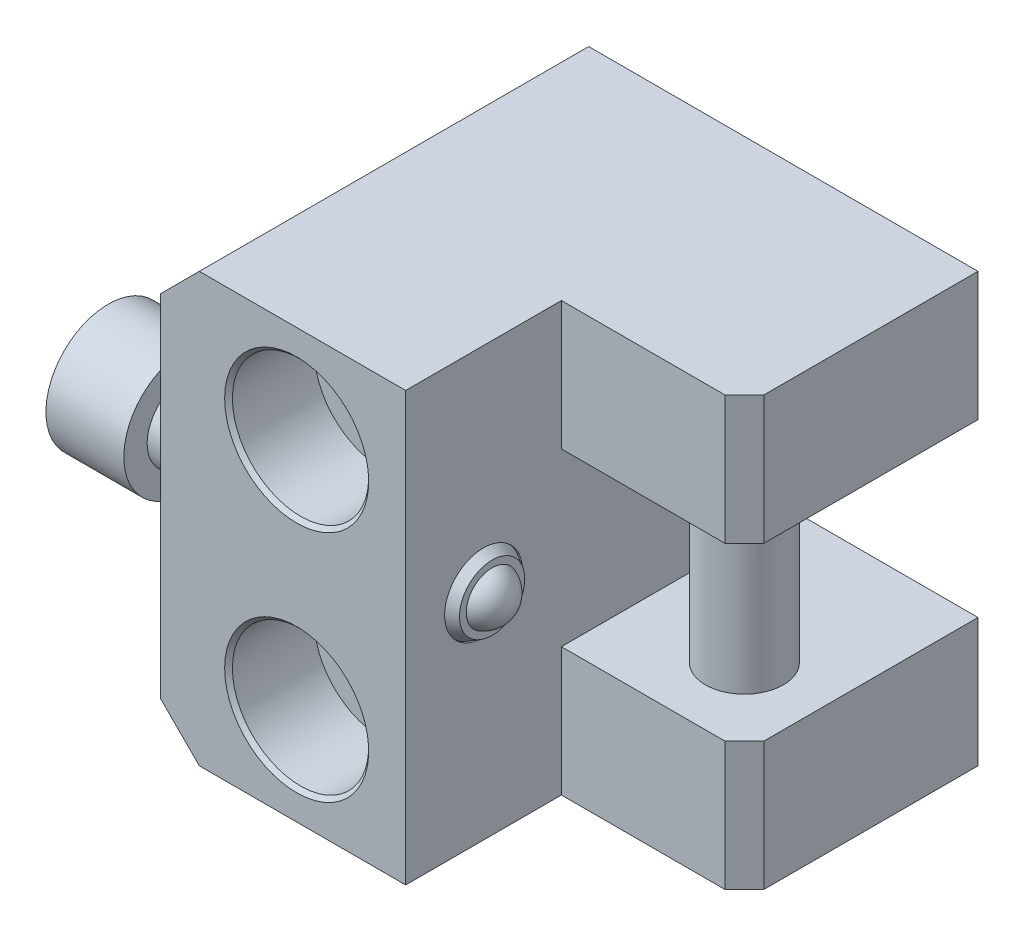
ISO-10303-21;
HEADER;
FILE_DESCRIPTION(('STEP AP214'),'2;1');
FILE_NAME('part.step','',(''),(''),'','','');
FILE_SCHEMA(('AUTOMOTIVE_DESIGN { 1 0 10303 214 1 1 1 1 }'));
ENDSEC;
DATA;
#1=APPLICATION_CONTEXT('core data for automotive mechanical design processes');
#2=APPLICATION_PROTOCOL_DEFINITION('international standard','automotive_design',2000,#1);
#3=PRODUCT_CONTEXT('',#1,'mechanical');
#4=PRODUCT('Part','Part','',(#3));
#5=PRODUCT_RELATED_PRODUCT_CATEGORY('part','',(#4));
#6=PRODUCT_DEFINITION_FORMATION('','',#4);
#7=PRODUCT_DEFINITION_CONTEXT('part definition',#1,'design');
#8=PRODUCT_DEFINITION('design','',#6,#7);
#9=PRODUCT_DEFINITION_SHAPE('','',#8);
#10=(LENGTH_UNIT() NAMED_UNIT(*) SI_UNIT(.MILLI.,.METRE.));
#11=(NAMED_UNIT(*) PLANE_ANGLE_UNIT() SI_UNIT($,.RADIAN.));
#12=(NAMED_UNIT(*) SI_UNIT($,.STERADIAN.) SOLID_ANGLE_UNIT());
#13=UNCERTAINTY_MEASURE_WITH_UNIT(LENGTH_MEASURE(1.E-05),#10,'distance_accuracy_value','');
#14=(GEOMETRIC_REPRESENTATION_CONTEXT(3) GLOBAL_UNCERTAINTY_ASSIGNED_CONTEXT((#13)) GLOBAL_UNIT_ASSIGNED_CONTEXT((#10,
#11,#12)) REPRESENTATION_CONTEXT('',''));
#15=CARTESIAN_POINT('',(0.,0.,0.));
#16=DIRECTION('',(0.,0.,1.));
#17=DIRECTION('',(1.,0.,0.));
#18=AXIS2_PLACEMENT_3D('',#15,#16,#17);
#19=CARTESIAN_POINT('',(-29.2000000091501,22.306119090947,43.25892983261));
#20=DIRECTION('',(-1.,-4.10206894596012E-10,0.));
#21=DIRECTION('',(3.74627505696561E-10,-0.913264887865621,-0.407366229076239));
#22=AXIS2_PLACEMENT_3D('',#19,#20,#21);
#23=PLANE('',#22);
#24=DIRECTION('',(2.40884665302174E-10,-0.587227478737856,-0.809421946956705));
#25=VECTOR('',#24,1.);
#26=CARTESIAN_POINT('',(-29.2000000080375,19.5938315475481,39.5203700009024));
#27=LINE('',#26,#25);
#28=CARTESIAN_POINT('',(-29.2000000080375,19.5938315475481,39.5203700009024));
#29=VERTEX_POINT('',#28);
#30=CARTESIAN_POINT('',(-29.2000000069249,16.8815440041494,35.7818101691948));
#31=VERTEX_POINT('',#30);
#32=EDGE_CURVE('E372',#29,#31,#27,.T.);
#33=ORIENTED_EDGE('',*,*,#32,.T.);
#34=DIRECTION('',(-4.0798920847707E-10,0.994593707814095,-0.103842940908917));
#35=VECTOR('',#34,1.);
#36=CARTESIAN_POINT('',(-29.2000000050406,12.2877124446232,36.2614401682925));
#37=LINE('',#36,#35);
#38=CARTESIAN_POINT('',(-29.2000000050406,12.2877124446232,36.2614401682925));
#39=VERTEX_POINT('',#38);
#40=EDGE_CURVE('E374',#39,#31,#37,.T.);
#41=ORIENTED_EDGE('',*,*,#40,.F.);
#42=DIRECTION('',(-1.67104543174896E-10,0.407366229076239,-0.913264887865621));
#43=VECTOR('',#42,1.);
#44=CARTESIAN_POINT('',(-29.2000000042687,10.4061684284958,40.4796299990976));
#45=LINE('',#44,#43);
#46=CARTESIAN_POINT('',(-29.2000000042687,10.4061684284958,40.4796299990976));
#47=VERTEX_POINT('',#46);
#48=EDGE_CURVE('E377',#47,#39,#45,.T.);
#49=ORIENTED_EDGE('',*,*,#48,.F.);
#50=DIRECTION('',(-2.40884665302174E-10,0.587227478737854,0.809421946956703));
#51=VECTOR('',#50,1.);
#52=CARTESIAN_POINT('',(-29.2000000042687,10.4061684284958,40.4796299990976));
#53=LINE('',#52,#51);
#54=CARTESIAN_POINT('',(-29.2000000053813,13.1184559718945,44.2181898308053));
#55=VERTEX_POINT('',#54);
#56=EDGE_CURVE('E182',#47,#55,#53,.T.);
#57=ORIENTED_EDGE('',*,*,#56,.T.);
#58=DIRECTION('',(4.0798920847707E-10,-0.994593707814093,0.103842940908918));
#59=VECTOR('',#58,1.);
#60=CARTESIAN_POINT('',(-29.2000000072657,17.7122875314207,43.7385598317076));
#61=LINE('',#60,#59);
#62=CARTESIAN_POINT('',(-29.2000000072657,17.7122875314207,43.7385598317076));
#63=VERTEX_POINT('',#62);
#64=EDGE_CURVE('E165',#63,#55,#61,.T.);
#65=ORIENTED_EDGE('',*,*,#64,.F.);
#66=DIRECTION('',(-1.67104543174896E-10,0.407366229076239,-0.913264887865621));
#67=VECTOR('',#66,1.);
#68=CARTESIAN_POINT('',(-29.2000000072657,17.7122875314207,43.7385598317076));
#69=LINE('',#68,#67);
#70=EDGE_CURVE('E179',#63,#29,#69,.T.);
#71=ORIENTED_EDGE('',*,*,#70,.T.);
#72=EDGE_LOOP('',(#33,#41,#49,#57,#65,#71));
#73=FACE_BOUND('',#72,.T.);
#74=ADVANCED_FACE('F14',(#73),#23,.T.);
#75=CARTESIAN_POINT('',(-29.2000000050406,12.2877124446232,36.2614401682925));
#76=DIRECTION('',(-4.25969733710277E-11,0.103842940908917,0.994593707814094));
#77=DIRECTION('',(4.0798920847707E-10,-0.994593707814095,0.103842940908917));
#78=AXIS2_PLACEMENT_3D('',#75,#76,#77);
#79=PLANE('',#78);
#80=ORIENTED_EDGE('',*,*,#40,.T.);
#81=DIRECTION('',(-1.,-4.10206894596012E-10,0.));
#82=VECTOR('',#81,1.);
#83=CARTESIAN_POINT('',(-29.2000000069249,16.8815440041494,35.7818101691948));
#84=LINE('',#83,#82);
#85=CARTESIAN_POINT('',(-34.2000000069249,16.8815440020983,35.7818101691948));
#86=VERTEX_POINT('',#85);
#87=EDGE_CURVE('E186',#31,#86,#84,.T.);
#88=ORIENTED_EDGE('',*,*,#87,.T.);
#89=DIRECTION('',(-4.0798920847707E-10,0.994593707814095,-0.103842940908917));
#90=VECTOR('',#89,1.);
#91=CARTESIAN_POINT('',(-34.2000000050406,12.2877124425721,36.2614401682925));
#92=LINE('',#91,#90);
#93=CARTESIAN_POINT('',(-34.2000000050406,12.2877124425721,36.2614401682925));
#94=VERTEX_POINT('',#93);
#95=EDGE_CURVE('E358',#94,#86,#92,.T.);
#96=ORIENTED_EDGE('',*,*,#95,.F.);
#97=DIRECTION('',(-1.,-4.10206894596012E-10,0.));
#98=VECTOR('',#97,1.);
#99=CARTESIAN_POINT('',(-29.2000000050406,12.2877124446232,36.2614401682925));
#100=LINE('',#99,#98);
#101=EDGE_CURVE('E136',#39,#94,#100,.T.);
#102=ORIENTED_EDGE('',*,*,#101,.F.);
#103=EDGE_LOOP('',(#80,#88,#96,#102));
#104=FACE_BOUND('',#103,.T.);
#105=ADVANCED_FACE('F387',(#104),#79,.T.);
#106=CARTESIAN_POINT('',(-29.2000000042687,10.4061684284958,40.4796299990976));
#107=DIRECTION('',(-3.74627505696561E-10,0.913264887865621,0.407366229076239));
#108=DIRECTION('',(-1.,-4.10206894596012E-10,0.));
#109=AXIS2_PLACEMENT_3D('',#106,#107,#108);
#110=PLANE('',#109);
#111=ORIENTED_EDGE('',*,*,#101,.T.);
#112=DIRECTION('',(-1.67104543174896E-10,0.407366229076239,-0.913264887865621));
#113=VECTOR('',#112,1.);
#114=CARTESIAN_POINT('',(-34.2000000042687,10.4061684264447,40.4796299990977));
#115=LINE('',#114,#113);
#116=CARTESIAN_POINT('',(-34.2000000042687,10.4061684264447,40.4796299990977));
#117=VERTEX_POINT('',#116);
#118=EDGE_CURVE('E361',#117,#94,#115,.T.);
#119=ORIENTED_EDGE('',*,*,#118,.F.);
#120=DIRECTION('',(-1.,-4.10206894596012E-10,0.));
#121=VECTOR('',#120,1.);
#122=CARTESIAN_POINT('',(-29.2000000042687,10.4061684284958,40.4796299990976));
#123=LINE('',#122,#121);
#124=EDGE_CURVE('E192',#47,#117,#123,.T.);
#125=ORIENTED_EDGE('',*,*,#124,.F.);
#126=ORIENTED_EDGE('',*,*,#48,.T.);
#127=EDGE_LOOP('',(#111,#119,#125,#126));
#128=FACE_BOUND('',#127,.T.);
#129=ADVANCED_FACE('F378',(#128),#110,.T.);
#130=CARTESIAN_POINT('',(-29.2000000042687,10.4061684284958,40.4796299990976));
#131=DIRECTION('',(3.32030532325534E-10,-0.809421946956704,0.587227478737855));
#132=DIRECTION('',(2.40884665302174E-10,-0.587227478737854,-0.809421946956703));
#133=AXIS2_PLACEMENT_3D('',#130,#131,#132);
#134=PLANE('',#133);
#135=ORIENTED_EDGE('',*,*,#124,.T.);
#136=DIRECTION('',(-2.40884665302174E-10,0.587227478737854,0.809421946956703));
#137=VECTOR('',#136,1.);
#138=CARTESIAN_POINT('',(-34.2000000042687,10.4061684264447,40.4796299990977));
#139=LINE('',#138,#137);
#140=CARTESIAN_POINT('',(-34.2000000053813,13.1184559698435,44.2181898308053));
#141=VERTEX_POINT('',#140);
#142=EDGE_CURVE('E366',#117,#141,#139,.T.);
#143=ORIENTED_EDGE('',*,*,#142,.T.);
#144=DIRECTION('',(-1.,-4.10206894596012E-10,0.));
#145=VECTOR('',#144,1.);
#146=CARTESIAN_POINT('',(-29.2000000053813,13.1184559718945,44.2181898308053));
#147=LINE('',#146,#145);
#148=EDGE_CURVE('E173',#55,#141,#147,.T.);
#149=ORIENTED_EDGE('',*,*,#148,.F.);
#150=ORIENTED_EDGE('',*,*,#56,.F.);
#151=EDGE_LOOP('',(#135,#143,#149,#150));
#152=FACE_BOUND('',#151,.T.);
#153=ADVANCED_FACE('F381',(#152),#134,.F.);
#154=CARTESIAN_POINT('',(-29.2000000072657,17.7122875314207,43.7385598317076));
#155=DIRECTION('',(4.2596973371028E-11,-0.103842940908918,-0.994593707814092));
#156=DIRECTION('',(-4.0798920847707E-10,0.994593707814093,-0.103842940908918));
#157=AXIS2_PLACEMENT_3D('',#154,#155,#156);
#158=PLANE('',#157);
#159=ORIENTED_EDGE('',*,*,#148,.T.);
#160=DIRECTION('',(4.0798920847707E-10,-0.994593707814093,0.103842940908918));
#161=VECTOR('',#160,1.);
#162=CARTESIAN_POINT('',(-34.2000000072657,17.7122875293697,43.7385598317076));
#163=LINE('',#162,#161);
#164=CARTESIAN_POINT('',(-34.2000000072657,17.7122875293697,43.7385598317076));
#165=VERTEX_POINT('',#164);
#166=EDGE_CURVE('E167',#165,#141,#163,.T.);
#167=ORIENTED_EDGE('',*,*,#166,.F.);
#168=DIRECTION('',(-1.,-4.10206894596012E-10,0.));
#169=VECTOR('',#168,1.);
#170=CARTESIAN_POINT('',(-29.2000000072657,17.7122875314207,43.7385598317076));
#171=LINE('',#170,#169);
#172=EDGE_CURVE('E162',#63,#165,#171,.T.);
#173=ORIENTED_EDGE('',*,*,#172,.F.);
#174=ORIENTED_EDGE('',*,*,#64,.T.);
#175=EDGE_LOOP('',(#159,#167,#173,#174));
#176=FACE_BOUND('',#175,.T.);
#177=ADVANCED_FACE('F164',(#176),#158,.T.);
#178=CARTESIAN_POINT('',(-29.2000000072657,17.7122875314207,43.7385598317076));
#179=DIRECTION('',(-3.74627505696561E-10,0.913264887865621,0.407366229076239));
#180=DIRECTION('',(-1.,-4.10206894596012E-10,0.));
#181=AXIS2_PLACEMENT_3D('',#178,#179,#180);
#182=PLANE('',#181);
#183=ORIENTED_EDGE('',*,*,#172,.T.);
#184=DIRECTION('',(-1.67104543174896E-10,0.407366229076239,-0.913264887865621));
#185=VECTOR('',#184,1.);
#186=CARTESIAN_POINT('',(-34.2000000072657,17.7122875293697,43.7385598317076));
#187=LINE('',#186,#185);
#188=CARTESIAN_POINT('',(-34.2000000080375,19.5938315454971,39.5203700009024));
#189=VERTEX_POINT('',#188);
#190=EDGE_CURVE('E370',#165,#189,#187,.T.);
#191=ORIENTED_EDGE('',*,*,#190,.T.);
#192=DIRECTION('',(-1.,-4.10206894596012E-10,0.));
#193=VECTOR('',#192,1.);
#194=CARTESIAN_POINT('',(-29.2000000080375,19.5938315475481,39.5203700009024));
#195=LINE('',#194,#193);
#196=EDGE_CURVE('E172',#29,#189,#195,.T.);
#197=ORIENTED_EDGE('',*,*,#196,.F.);
#198=ORIENTED_EDGE('',*,*,#70,.F.);
#199=EDGE_LOOP('',(#183,#191,#197,#198));
#200=FACE_BOUND('',#199,.T.);
#201=ADVANCED_FACE('F184',(#200),#182,.F.);
#202=CARTESIAN_POINT('',(-29.2000000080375,19.5938315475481,39.5203700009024));
#203=DIRECTION('',(-3.32030532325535E-10,0.809421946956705,-0.587227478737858));
#204=DIRECTION('',(-2.40884665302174E-10,0.587227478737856,0.809421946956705));
#205=AXIS2_PLACEMENT_3D('',#202,#203,#204);
#206=PLANE('',#205);
#207=ORIENTED_EDGE('',*,*,#196,.T.);
#208=DIRECTION('',(2.40884665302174E-10,-0.587227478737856,-0.809421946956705));
#209=VECTOR('',#208,1.);
#210=CARTESIAN_POINT('',(-34.2000000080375,19.5938315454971,39.5203700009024));
#211=LINE('',#210,#209);
#212=EDGE_CURVE('E33',#189,#86,#211,.T.);
#213=ORIENTED_EDGE('',*,*,#212,.T.);
#214=ORIENTED_EDGE('',*,*,#87,.F.);
#215=ORIENTED_EDGE('',*,*,#32,.F.);
#216=EDGE_LOOP('',(#207,#213,#214,#215));
#217=FACE_BOUND('',#216,.T.);
#218=ADVANCED_FACE('F388',(#217),#206,.F.);
#219=CARTESIAN_POINT('',(-34.2000000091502,22.3061190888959,43.25892983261));
#220=DIRECTION('',(-1.,-4.10206894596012E-10,0.));
#221=DIRECTION('',(3.74627505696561E-10,-0.913264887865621,-0.407366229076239));
#222=AXIS2_PLACEMENT_3D('',#219,#220,#221);
#223=PLANE('',#222);
#224=ORIENTED_EDGE('',*,*,#212,.F.);
#225=ORIENTED_EDGE('',*,*,#190,.F.);
#226=ORIENTED_EDGE('',*,*,#166,.T.);
#227=ORIENTED_EDGE('',*,*,#142,.F.);
#228=ORIENTED_EDGE('',*,*,#118,.T.);
#229=ORIENTED_EDGE('',*,*,#95,.T.);
#230=EDGE_LOOP('',(#224,#225,#226,#227,#228,#229));
#231=FACE_BOUND('',#230,.T.);
#232=CARTESIAN_POINT('',(-34.2000000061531,14.9999999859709,40.));
#233=DIRECTION('',(1.,4.10206894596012E-10,0.));
#234=DIRECTION('',(-3.74627505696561E-10,0.913264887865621,0.407366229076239));
#235=AXIS2_PLACEMENT_3D('',#232,#233,#234);
#236=CIRCLE('',#235,8.);
#237=CARTESIAN_POINT('',(-34.2000000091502,22.3061190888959,43.2589298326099));
#238=VERTEX_POINT('',#237);
#239=EDGE_CURVE('E196',#238,#238,#236,.T.);
#240=ORIENTED_EDGE('',*,*,#239,.F.);
#241=EDGE_LOOP('',(#240));
#242=FACE_BOUND('',#241,.T.);
#243=ADVANCED_FACE('F384',(#231,#242),#223,.T.);
#244=CARTESIAN_POINT('',(25.7999999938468,15.0000000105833,40.));
#245=DIRECTION('',(1.,4.10206894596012E-10,0.));
#246=DIRECTION('',(-3.74627505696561E-10,0.913264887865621,0.407366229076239));
#247=AXIS2_PLACEMENT_3D('',#244,#245,#246);
#248=CYLINDRICAL_SURFACE('',#247,8.);
#249=ORIENTED_EDGE('',*,*,#239,.T.);
#250=EDGE_LOOP('',(#249));
#251=FACE_BOUND('',#250,.T.);
#252=CARTESIAN_POINT('',(-24.2000000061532,14.999999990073,40.));
#253=DIRECTION('',(1.,4.10206894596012E-10,0.));
#254=DIRECTION('',(-3.74627505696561E-10,0.913264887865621,0.407366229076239));
#255=AXIS2_PLACEMENT_3D('',#252,#253,#254);
#256=CIRCLE('',#255,8.);
#257=CARTESIAN_POINT('',(-24.2000000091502,22.306119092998,43.2589298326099));
#258=VERTEX_POINT('',#257);
#259=EDGE_CURVE('E199',#258,#258,#256,.T.);
#260=ORIENTED_EDGE('',*,*,#259,.F.);
#261=EDGE_LOOP('',(#260));
#262=FACE_BOUND('',#261,.T.);
#263=ADVANCED_FACE('F397',(#251,#262),#248,.T.);
#264=CARTESIAN_POINT('',(-24.2000000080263,19.5663244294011,42.0368311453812));
#265=DIRECTION('',(1.,4.10206894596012E-10,0.));
#266=DIRECTION('',(-3.74627505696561E-10,0.913264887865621,0.407366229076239));
#267=AXIS2_PLACEMENT_3D('',#264,#265,#266);
#268=PLANE('',#267);
#269=ORIENTED_EDGE('',*,*,#259,.T.);
#270=EDGE_LOOP('',(#269));
#271=FACE_BOUND('',#270,.T.);
#272=CARTESIAN_POINT('',(-24.2000000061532,14.999999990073,40.));
#273=DIRECTION('',(1.,4.10206894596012E-10,0.));
#274=DIRECTION('',(-3.74627505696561E-10,0.913264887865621,0.407366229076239));
#275=AXIS2_PLACEMENT_3D('',#272,#273,#274);
#276=CIRCLE('',#275,5.);
#277=CARTESIAN_POINT('',(-24.2000000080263,19.5663244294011,42.0368311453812));
#278=VERTEX_POINT('',#277);
#279=EDGE_CURVE('E202',#278,#278,#276,.T.);
#280=ORIENTED_EDGE('',*,*,#279,.F.);
#281=EDGE_LOOP('',(#280));
#282=FACE_BOUND('',#281,.T.);
#283=ADVANCED_FACE('F419',(#271,#282),#268,.T.);
#284=CARTESIAN_POINT('',(25.7999999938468,15.0000000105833,40.));
#285=DIRECTION('',(1.,4.10206894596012E-10,0.));
#286=DIRECTION('',(-3.74627505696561E-10,0.913264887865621,0.407366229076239));
#287=AXIS2_PLACEMENT_3D('',#284,#285,#286);
#288=CYLINDRICAL_SURFACE('',#287,5.);
#289=ORIENTED_EDGE('',*,*,#279,.T.);
#290=EDGE_LOOP('',(#289));
#291=FACE_BOUND('',#290,.T.);
#292=CARTESIAN_POINT('',(-17.5000000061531,14.9999999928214,40.));
#293=DIRECTION('',(-1.,-4.10206857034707E-10,0.));
#294=DIRECTION('',(0.,0.,-1.));
#295=AXIS2_PLACEMENT_3D('',#292,#293,#294);
#296=CIRCLE('',#295,5.);
#297=CARTESIAN_POINT('',(-17.5000000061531,14.9999999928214,35.));
#298=VERTEX_POINT('',#297);
#299=EDGE_CURVE('E9',#298,#298,#296,.T.);
#300=ORIENTED_EDGE('',*,*,#299,.T.);
#301=EDGE_LOOP('',(#300));
#302=FACE_BOUND('',#301,.T.);
#303=ADVANCED_FACE('F423',(#291,#302),#288,.T.);
#304=CARTESIAN_POINT('',(13.9999999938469,15.0000000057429,40.));
#305=DIRECTION('',(1.,4.10206894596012E-10,0.));
#306=DIRECTION('',(-3.74627505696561E-10,0.913264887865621,0.407366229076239));
#307=AXIS2_PLACEMENT_3D('',#304,#305,#306);
#308=SPHERICAL_SURFACE('',#307,3.5);
#309=CARTESIAN_POINT('',(15.0999999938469,15.0000000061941,40.));
#310=DIRECTION('',(1.,4.10206894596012E-10,0.));
#311=DIRECTION('',(-3.74627505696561E-10,0.913264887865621,0.407366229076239));
#312=AXIS2_PLACEMENT_3D('',#309,#310,#311);
#313=CIRCLE('',#312,3.32264954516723);
#314=CARTESIAN_POINT('',(15.0999999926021,18.0344591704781,41.3535352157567));
#315=VERTEX_POINT('',#314);
#316=EDGE_CURVE('E24',#315,#315,#313,.T.);
#317=ORIENTED_EDGE('',*,*,#316,.T.);
#318=EDGE_LOOP('',(#317));
#319=FACE_BOUND('',#318,.T.);
#320=ADVANCED_FACE('F427',(#319),#308,.T.);
#321=CARTESIAN_POINT('',(15.0999999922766,18.8281412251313,41.7075609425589));
#322=DIRECTION('',(-1.,-4.10206894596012E-10,0.));
#323=DIRECTION('',(3.74627505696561E-10,-0.913264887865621,-0.407366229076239));
#324=AXIS2_PLACEMENT_3D('',#321,#322,#323);
#325=PLANE('',#324);
#326=ORIENTED_EDGE('',*,*,#316,.F.);
#327=EDGE_LOOP('',(#326));
#328=FACE_BOUND('',#327,.T.);
#329=CARTESIAN_POINT('',(15.0999999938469,15.0000000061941,40.));
#330=DIRECTION('',(1.,4.10206894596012E-10,0.));
#331=DIRECTION('',(-3.74627505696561E-10,0.913264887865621,0.407366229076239));
#332=AXIS2_PLACEMENT_3D('',#329,#330,#331);
#333=CIRCLE('',#332,4.19170962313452);
#334=CARTESIAN_POINT('',(15.0999999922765,18.8281412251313,41.7075609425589));
#335=VERTEX_POINT('',#334);
#336=EDGE_CURVE('E208',#335,#335,#333,.T.);
#337=ORIENTED_EDGE('',*,*,#336,.T.);
#338=EDGE_LOOP('',(#337));
#339=FACE_BOUND('',#338,.T.);
#340=ADVANCED_FACE('F434',(#328,#339),#325,.F.);
#341=CARTESIAN_POINT('',(13.6999999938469,15.0000000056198,40.));
#342=DIRECTION('',(-1.,-4.10206894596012E-10,0.));
#343=DIRECTION('',(3.74627505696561E-10,-0.913264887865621,-0.407366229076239));
#344=AXIS2_PLACEMENT_3D('',#341,#342,#343);
#345=CONICAL_SURFACE('',#344,5.,0.523598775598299);
#346=ORIENTED_EDGE('',*,*,#336,.F.);
#347=EDGE_LOOP('',(#346));
#348=FACE_BOUND('',#347,.T.);
#349=CARTESIAN_POINT('',(13.6999999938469,15.0000000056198,40.));
#350=DIRECTION('',(1.,4.10206894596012E-10,0.));
#351=DIRECTION('',(-3.74627505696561E-10,0.913264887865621,0.407366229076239));
#352=AXIS2_PLACEMENT_3D('',#349,#350,#351);
#353=CIRCLE('',#352,5.);
#354=CARTESIAN_POINT('',(13.6999999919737,19.566324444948,42.0368311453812));
#355=VERTEX_POINT('',#354);
#356=EDGE_CURVE('E205',#355,#355,#353,.T.);
#357=ORIENTED_EDGE('',*,*,#356,.T.);
#358=EDGE_LOOP('',(#357));
#359=FACE_BOUND('',#358,.T.);
#360=ADVANCED_FACE('F430',(#348,#359),#345,.T.);
#361=CARTESIAN_POINT('',(-8.75000001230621,29.9999999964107,38.997116));
#362=DIRECTION('',(0.,0.,-1.));
#363=DIRECTION('',(1.,4.10206857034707E-10,0.));
#364=AXIS2_PLACEMENT_3D('',#361,#362,#363);
#365=PLANE('',#364);
#366=CARTESIAN_POINT('',(-1.23062046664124E-08,30.,38.997116));
#367=DIRECTION('',(0.,0.,1.));
#368=DIRECTION('',(-1.,-4.10206857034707E-10,0.));
#369=AXIS2_PLACEMENT_3D('',#366,#367,#368);
#370=CIRCLE('',#369,5.5);
#371=CARTESIAN_POINT('',(-5.5000000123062,29.9999999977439,38.997116));
#372=VERTEX_POINT('',#371);
#373=EDGE_CURVE('E267',#372,#372,#370,.T.);
#374=ORIENTED_EDGE('',*,*,#373,.F.);
#375=EDGE_LOOP('',(#374));
#376=FACE_BOUND('',#375,.T.);
#377=CARTESIAN_POINT('',(-1.23062046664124E-08,30.,38.997116));
#378=DIRECTION('',(0.,0.,1.));
#379=DIRECTION('',(-1.,-4.10206857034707E-10,0.));
#380=AXIS2_PLACEMENT_3D('',#377,#378,#379);
#381=CIRCLE('',#380,8.75);
#382=CARTESIAN_POINT('',(-8.75000001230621,29.9999999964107,38.997116));
#383=VERTEX_POINT('',#382);
#384=EDGE_CURVE('E264',#383,#383,#381,.T.);
#385=ORIENTED_EDGE('',*,*,#384,.T.);
#386=EDGE_LOOP('',(#385));
#387=FACE_BOUND('',#386,.T.);
#388=ADVANCED_FACE('F433',(#376,#387),#365,.F.);
#389=CARTESIAN_POINT('',(-8.75,-3.58928511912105E-09,38.997116));
#390=DIRECTION('',(0.,0.,-1.));
#391=DIRECTION('',(1.,4.10206857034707E-10,0.));
#392=AXIS2_PLACEMENT_3D('',#389,#390,#391);
#393=PLANE('',#392);
#394=CARTESIAN_POINT('',(0.,0.,38.997116));
#395=DIRECTION('',(0.,0.,1.));
#396=DIRECTION('',(-1.,-4.10206857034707E-10,0.));
#397=AXIS2_PLACEMENT_3D('',#394,#395,#396);
#398=CIRCLE('',#397,5.5);
#399=CARTESIAN_POINT('',(-5.5,-2.25611342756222E-09,38.997116));
#400=VERTEX_POINT('',#399);
#401=EDGE_CURVE('E249',#400,#400,#398,.T.);
#402=ORIENTED_EDGE('',*,*,#401,.F.);
#403=EDGE_LOOP('',(#402));
#404=FACE_BOUND('',#403,.T.);
#405=CARTESIAN_POINT('',(0.,0.,38.997116));
#406=DIRECTION('',(0.,0.,1.));
#407=DIRECTION('',(-1.,-4.10206857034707E-10,0.));
#408=AXIS2_PLACEMENT_3D('',#405,#406,#407);
#409=CIRCLE('',#408,8.75);
#410=CARTESIAN_POINT('',(-8.75,-3.58928571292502E-09,38.997116));
#411=VERTEX_POINT('',#410);
#412=EDGE_CURVE('E246',#411,#411,#409,.T.);
#413=ORIENTED_EDGE('',*,*,#412,.T.);
#414=EDGE_LOOP('',(#413));
#415=FACE_BOUND('',#414,.T.);
#416=ADVANCED_FACE('F489',(#404,#415),#393,.F.);
#417=CARTESIAN_POINT('',(27.4999999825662,42.5000000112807,20.));
#418=DIRECTION('',(4.10206948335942E-10,-1.,0.));
#419=DIRECTION('',(1.,4.10206948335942E-10,0.));
#420=AXIS2_PLACEMENT_3D('',#417,#418,#419);
#421=CYLINDRICAL_SURFACE('',#420,5.);
#422=CARTESIAN_POINT('',(27.4999999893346,26.0000000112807,20.));
#423=DIRECTION('',(-4.10207011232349E-10,1.,0.));
#424=DIRECTION('',(-1.,-4.10207011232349E-10,0.));
#425=AXIS2_PLACEMENT_3D('',#422,#423,#424);
#426=CIRCLE('',#425,5.);
#427=CARTESIAN_POINT('',(22.4999999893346,26.0000000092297,20.));
#428=VERTEX_POINT('',#427);
#429=EDGE_CURVE('E351',#428,#428,#426,.T.);
#430=ORIENTED_EDGE('',*,*,#429,.F.);
#431=EDGE_LOOP('',(#430));
#432=FACE_BOUND('',#431,.T.);
#433=CARTESIAN_POINT('',(27.4999999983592,4.00000001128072,20.));
#434=DIRECTION('',(4.10207011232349E-10,-1.,0.));
#435=DIRECTION('',(1.,4.10207011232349E-10,0.));
#436=AXIS2_PLACEMENT_3D('',#433,#434,#435);
#437=CIRCLE('',#436,5.);
#438=CARTESIAN_POINT('',(32.4999999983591,4.00000001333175,20.));
#439=VERTEX_POINT('',#438);
#440=EDGE_CURVE('E18',#439,#439,#437,.T.);
#441=ORIENTED_EDGE('',*,*,#440,.F.);
#442=EDGE_LOOP('',(#441));
#443=FACE_BOUND('',#442,.T.);
#444=ADVANCED_FACE('F16',(#432,#443),#421,.T.);
#445=CARTESIAN_POINT('',(-1.23062046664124E-08,30.,50.));
#446=DIRECTION('',(0.,0.,1.));
#447=DIRECTION('',(-1.,-4.10206857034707E-10,0.));
#448=AXIS2_PLACEMENT_3D('',#445,#446,#447);
#449=CYLINDRICAL_SURFACE('',#448,5.5);
#450=CARTESIAN_POINT('',(-1.23062046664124E-08,30.,0.499999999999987));
#451=DIRECTION('',(0.,0.,1.));
#452=DIRECTION('',(-1.,-4.10206857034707E-10,0.));
#453=AXIS2_PLACEMENT_3D('',#450,#451,#452);
#454=CIRCLE('',#453,5.5);
#455=CARTESIAN_POINT('',(-5.5000000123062,29.9999999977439,0.499999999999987));
#456=VERTEX_POINT('',#455);
#457=EDGE_CURVE('E270',#456,#456,#454,.T.);
#458=ORIENTED_EDGE('',*,*,#457,.F.);
#459=EDGE_LOOP('',(#458));
#460=FACE_BOUND('',#459,.T.);
#461=ORIENTED_EDGE('',*,*,#373,.T.);
#462=EDGE_LOOP('',(#461));
#463=FACE_BOUND('',#462,.T.);
#464=ADVANCED_FACE('F495',(#460,#463),#449,.F.);
#465=CARTESIAN_POINT('',(0.,0.,50.));
#466=DIRECTION('',(0.,0.,1.));
#467=DIRECTION('',(-1.,-4.10206857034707E-10,0.));
#468=AXIS2_PLACEMENT_3D('',#465,#466,#467);
#469=CYLINDRICAL_SURFACE('',#468,5.5);
#470=CARTESIAN_POINT('',(0.,0.,0.499999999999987));
#471=DIRECTION('',(0.,0.,1.));
#472=DIRECTION('',(-1.,-4.10206857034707E-10,0.));
#473=AXIS2_PLACEMENT_3D('',#470,#471,#472);
#474=CIRCLE('',#473,5.5);
#475=CARTESIAN_POINT('',(-5.5,-2.25611342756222E-09,0.499999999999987));
#476=VERTEX_POINT('',#475);
#477=EDGE_CURVE('E252',#476,#476,#474,.T.);
#478=ORIENTED_EDGE('',*,*,#477,.F.);
#479=EDGE_LOOP('',(#478));
#480=FACE_BOUND('',#479,.T.);
#481=ORIENTED_EDGE('',*,*,#401,.T.);
#482=EDGE_LOOP('',(#481));
#483=FACE_BOUND('',#482,.T.);
#484=ADVANCED_FACE('F446',(#480,#483),#469,.F.);
#485=CARTESIAN_POINT('',(34.9999999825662,42.5000000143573,30.));
#486=DIRECTION('',(0.707106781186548,2.90060139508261E-10,0.707106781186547));
#487=DIRECTION('',(-0.707106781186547,-2.90060050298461E-10,0.707106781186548));
#488=AXIS2_PLACEMENT_3D('',#485,#486,#487);
#489=PLANE('',#488);
#490=DIRECTION('',(-0.707106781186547,-2.90059961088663E-10,0.707106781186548));
#491=VECTOR('',#490,1.);
#492=CARTESIAN_POINT('',(35.0000000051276,-12.4999999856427,30.));
#493=LINE('',#492,#491);
#494=CARTESIAN_POINT('',(37.5000000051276,-12.4999999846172,27.5));
#495=VERTEX_POINT('',#494);
#496=CARTESIAN_POINT('',(35.0000000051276,-12.4999999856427,30.));
#497=VERTEX_POINT('',#496);
#498=EDGE_CURVE('E350',#495,#497,#493,.T.);
#499=ORIENTED_EDGE('',*,*,#498,.F.);
#500=DIRECTION('',(4.10206983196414E-10,-1.,0.));
#501=VECTOR('',#500,1.);
#502=CARTESIAN_POINT('',(37.5000000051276,-12.4999999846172,27.5));
#503=LINE('',#502,#501);
#504=CARTESIAN_POINT('',(37.4999999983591,4.00000001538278,27.5));
#505=VERTEX_POINT('',#504);
#506=EDGE_CURVE('E127',#505,#495,#503,.T.);
#507=ORIENTED_EDGE('',*,*,#506,.F.);
#508=DIRECTION('',(0.707106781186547,2.90060077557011E-10,-0.707106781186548));
#509=VECTOR('',#508,1.);
#510=CARTESIAN_POINT('',(34.9999999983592,4.00000001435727,30.));
#511=LINE('',#510,#509);
#512=CARTESIAN_POINT('',(34.9999999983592,4.00000001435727,30.));
#513=VERTEX_POINT('',#512);
#514=EDGE_CURVE('E121',#513,#505,#511,.T.);
#515=ORIENTED_EDGE('',*,*,#514,.F.);
#516=DIRECTION('',(-4.10206983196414E-10,1.,0.));
#517=VECTOR('',#516,1.);
#518=CARTESIAN_POINT('',(34.9999999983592,4.00000001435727,30.));
#519=LINE('',#518,#517);
#520=EDGE_CURVE('E345',#497,#513,#519,.T.);
#521=ORIENTED_EDGE('',*,*,#520,.F.);
#522=EDGE_LOOP('',(#499,#507,#515,#521));
#523=FACE_BOUND('',#522,.T.);
#524=ADVANCED_FACE('F442',(#523),#489,.T.);
#525=CARTESIAN_POINT('',(34.9999999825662,42.5000000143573,30.));
#526=DIRECTION('',(0.707106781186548,2.90060139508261E-10,0.707106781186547));
#527=DIRECTION('',(-0.707106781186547,-2.90060050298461E-10,0.707106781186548));
#528=AXIS2_PLACEMENT_3D('',#525,#526,#527);
#529=PLANE('',#528);
#530=DIRECTION('',(-0.707106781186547,-2.90060241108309E-10,0.707106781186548));
#531=VECTOR('',#530,1.);
#532=CARTESIAN_POINT('',(34.9999999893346,26.0000000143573,30.));
#533=LINE('',#532,#531);
#534=CARTESIAN_POINT('',(37.4999999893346,26.0000000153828,27.5));
#535=VERTEX_POINT('',#534);
#536=CARTESIAN_POINT('',(34.9999999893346,26.0000000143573,30.));
#537=VERTEX_POINT('',#536);
#538=EDGE_CURVE('E343',#535,#537,#533,.T.);
#539=ORIENTED_EDGE('',*,*,#538,.F.);
#540=DIRECTION('',(4.10206983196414E-10,-1.,0.));
#541=VECTOR('',#540,1.);
#542=CARTESIAN_POINT('',(37.4999999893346,26.0000000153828,27.5));
#543=LINE('',#542,#541);
#544=CARTESIAN_POINT('',(37.4999999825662,42.5000000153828,27.5));
#545=VERTEX_POINT('',#544);
#546=EDGE_CURVE('E341',#545,#535,#543,.T.);
#547=ORIENTED_EDGE('',*,*,#546,.F.);
#548=DIRECTION('',(0.707106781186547,2.90060050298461E-10,-0.707106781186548));
#549=VECTOR('',#548,1.);
#550=CARTESIAN_POINT('',(34.9999999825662,42.5000000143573,30.));
#551=LINE('',#550,#549);
#552=CARTESIAN_POINT('',(34.9999999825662,42.5000000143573,30.));
#553=VERTEX_POINT('',#552);
#554=EDGE_CURVE('E339',#553,#545,#551,.T.);
#555=ORIENTED_EDGE('',*,*,#554,.F.);
#556=DIRECTION('',(-4.10206983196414E-10,1.,0.));
#557=VECTOR('',#556,1.);
#558=CARTESIAN_POINT('',(34.9999999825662,42.5000000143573,30.));
#559=LINE('',#558,#557);
#560=EDGE_CURVE('E336',#537,#553,#559,.T.);
#561=ORIENTED_EDGE('',*,*,#560,.F.);
#562=EDGE_LOOP('',(#539,#547,#555,#561));
#563=FACE_BOUND('',#562,.T.);
#564=ADVANCED_FACE('F445',(#563),#529,.T.);
#565=CARTESIAN_POINT('',(-1.23062046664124E-08,30.,50.));
#566=DIRECTION('',(0.,0.,1.));
#567=DIRECTION('',(-1.,-4.10206857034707E-10,0.));
#568=AXIS2_PLACEMENT_3D('',#565,#566,#567);
#569=CYLINDRICAL_SURFACE('',#568,8.75);
#570=ORIENTED_EDGE('',*,*,#384,.F.);
#571=EDGE_LOOP('',(#570));
#572=FACE_BOUND('',#571,.T.);
#573=CARTESIAN_POINT('',(-1.23062046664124E-08,30.,49.5));
#574=DIRECTION('',(0.,0.,1.));
#575=DIRECTION('',(-1.,-4.10206857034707E-10,0.));
#576=AXIS2_PLACEMENT_3D('',#573,#574,#575);
#577=CIRCLE('',#576,8.75);
#578=CARTESIAN_POINT('',(-8.75000001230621,29.9999999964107,49.5));
#579=VERTEX_POINT('',#578);
#580=EDGE_CURVE('E261',#579,#579,#577,.T.);
#581=ORIENTED_EDGE('',*,*,#580,.T.);
#582=EDGE_LOOP('',(#581));
#583=FACE_BOUND('',#582,.T.);
#584=ADVANCED_FACE('F451',(#572,#583),#569,.F.);
#585=CARTESIAN_POINT('',(0.,0.,50.));
#586=DIRECTION('',(0.,0.,1.));
#587=DIRECTION('',(-1.,-4.10206857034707E-10,0.));
#588=AXIS2_PLACEMENT_3D('',#585,#586,#587);
#589=CYLINDRICAL_SURFACE('',#588,8.75);
#590=ORIENTED_EDGE('',*,*,#412,.F.);
#591=EDGE_LOOP('',(#590));
#592=FACE_BOUND('',#591,.T.);
#593=CARTESIAN_POINT('',(0.,0.,49.5));
#594=DIRECTION('',(0.,0.,1.));
#595=DIRECTION('',(-1.,-4.10206857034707E-10,0.));
#596=AXIS2_PLACEMENT_3D('',#593,#594,#595);
#597=CIRCLE('',#596,8.75);
#598=CARTESIAN_POINT('',(-8.75,-3.58928571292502E-09,49.5));
#599=VERTEX_POINT('',#598);
#600=EDGE_CURVE('E243',#599,#599,#597,.T.);
#601=ORIENTED_EDGE('',*,*,#600,.T.);
#602=EDGE_LOOP('',(#601));
#603=FACE_BOUND('',#602,.T.);
#604=ADVANCED_FACE('F484',(#592,#603),#589,.F.);
#605=CARTESIAN_POINT('',(37.4999999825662,42.5000000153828,30.));
#606=DIRECTION('',(0.,0.,1.));
#607=DIRECTION('',(-1.,-4.10206857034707E-10,0.));
#608=AXIS2_PLACEMENT_3D('',#605,#606,#607);
#609=PLANE('',#608);
#610=DIRECTION('',(1.,4.10207011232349E-10,0.));
#611=VECTOR('',#610,1.);
#612=CARTESIAN_POINT('',(-23.2021504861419,25.9999999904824,30.));
#613=LINE('',#612,#611);
#614=CARTESIAN_POINT('',(13.9999999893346,26.0000000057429,30.));
#615=VERTEX_POINT('',#614);
#616=EDGE_CURVE('E228',#615,#537,#613,.T.);
#617=ORIENTED_EDGE('',*,*,#616,.T.);
#618=ORIENTED_EDGE('',*,*,#560,.T.);
#619=DIRECTION('',(-1.,-4.10206857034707E-10,0.));
#620=VECTOR('',#619,1.);
#621=CARTESIAN_POINT('',(37.4999999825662,42.5000000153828,30.));
#622=LINE('',#621,#620);
#623=CARTESIAN_POINT('',(13.9999999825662,42.5000000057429,30.));
#624=VERTEX_POINT('',#623);
#625=EDGE_CURVE('E279',#553,#624,#622,.T.);
#626=ORIENTED_EDGE('',*,*,#625,.T.);
#627=DIRECTION('',(4.10206983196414E-10,-1.,0.));
#628=VECTOR('',#627,1.);
#629=CARTESIAN_POINT('',(14.0000000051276,-12.4999999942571,30.));
#630=LINE('',#629,#628);
#631=EDGE_CURVE('E282',#624,#615,#630,.T.);
#632=ORIENTED_EDGE('',*,*,#631,.T.);
#633=EDGE_LOOP('',(#617,#618,#626,#632));
#634=FACE_BOUND('',#633,.T.);
#635=ADVANCED_FACE('F487',(#634),#609,.T.);
#636=DIRECTION('',(1.,4.10206857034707E-10,0.));
#637=VECTOR('',#636,1.);
#638=CARTESIAN_POINT('',(37.5000000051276,-12.4999999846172,30.));
#639=LINE('',#638,#637);
#640=CARTESIAN_POINT('',(14.0000000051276,-12.4999999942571,30.));
#641=VERTEX_POINT('',#640);
#642=EDGE_CURVE('E285',#641,#497,#639,.T.);
#643=ORIENTED_EDGE('',*,*,#642,.T.);
#644=ORIENTED_EDGE('',*,*,#520,.T.);
#645=DIRECTION('',(1.,4.10207011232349E-10,0.));
#646=VECTOR('',#645,1.);
#647=CARTESIAN_POINT('',(-23.2021504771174,3.99999999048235,30.));
#648=LINE('',#647,#646);
#649=CARTESIAN_POINT('',(13.9999999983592,4.00000000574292,30.));
#650=VERTEX_POINT('',#649);
#651=EDGE_CURVE('E235',#650,#513,#648,.T.);
#652=ORIENTED_EDGE('',*,*,#651,.F.);
#653=EDGE_CURVE('E281',#650,#641,#630,.T.);
#654=ORIENTED_EDGE('',*,*,#653,.T.);
#655=EDGE_LOOP('',(#643,#644,#652,#654));
#656=FACE_BOUND('',#655,.T.);
#657=ADVANCED_FACE('F462',(#656),#609,.T.);
#658=CARTESIAN_POINT('',(-23.2021504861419,25.9999999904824,30.));
#659=DIRECTION('',(-4.10207011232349E-10,1.,0.));
#660=DIRECTION('',(-1.,-4.10207011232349E-10,0.));
#661=AXIS2_PLACEMENT_3D('',#658,#659,#660);
#662=PLANE('',#661);
#663=DIRECTION('',(0.,0.,1.));
#664=VECTOR('',#663,1.);
#665=CARTESIAN_POINT('',(37.4999999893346,26.0000000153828,30.));
#666=LINE('',#665,#664);
#667=CARTESIAN_POINT('',(37.4999999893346,26.0000000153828,0.));
#668=VERTEX_POINT('',#667);
#669=EDGE_CURVE('E217',#668,#535,#666,.T.);
#670=ORIENTED_EDGE('',*,*,#669,.T.);
#671=ORIENTED_EDGE('',*,*,#538,.T.);
#672=ORIENTED_EDGE('',*,*,#616,.F.);
#673=DIRECTION('',(0.,0.,1.));
#674=VECTOR('',#673,1.);
#675=CARTESIAN_POINT('',(13.9999999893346,26.0000000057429,30.));
#676=LINE('',#675,#674);
#677=CARTESIAN_POINT('',(13.9999999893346,26.0000000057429,0.));
#678=VERTEX_POINT('',#677);
#679=EDGE_CURVE('E225',#678,#615,#676,.T.);
#680=ORIENTED_EDGE('',*,*,#679,.F.);
#681=DIRECTION('',(1.,4.10207011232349E-10,0.));
#682=VECTOR('',#681,1.);
#683=CARTESIAN_POINT('',(-23.2021504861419,25.9999999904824,0.));
#684=LINE('',#683,#682);
#685=EDGE_CURVE('E229',#678,#668,#684,.T.);
#686=ORIENTED_EDGE('',*,*,#685,.T.);
#687=EDGE_LOOP('',(#670,#671,#672,#680,#686));
#688=FACE_BOUND('',#687,.T.);
#689=ORIENTED_EDGE('',*,*,#429,.T.);
#690=EDGE_LOOP('',(#689));
#691=FACE_BOUND('',#690,.T.);
#692=ADVANCED_FACE('F458',(#688,#691),#662,.F.);
#693=CARTESIAN_POINT('',(37.5000000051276,-12.4999999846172,50.));
#694=DIRECTION('',(-1.,-4.10206983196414E-10,0.));
#695=DIRECTION('',(4.10206983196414E-10,-1.,0.));
#696=AXIS2_PLACEMENT_3D('',#693,#694,#695);
#697=PLANE('',#696);
#698=DIRECTION('',(0.,0.,-1.));
#699=VECTOR('',#698,1.);
#700=CARTESIAN_POINT('',(37.4999999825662,42.5000000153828,50.));
#701=LINE('',#700,#699);
#702=CARTESIAN_POINT('',(37.4999999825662,42.5000000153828,0.));
#703=VERTEX_POINT('',#702);
#704=EDGE_CURVE('E316',#545,#703,#701,.T.);
#705=ORIENTED_EDGE('',*,*,#704,.F.);
#706=ORIENTED_EDGE('',*,*,#546,.T.);
#707=ORIENTED_EDGE('',*,*,#669,.F.);
#708=DIRECTION('',(-4.10206983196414E-10,1.,0.));
#709=VECTOR('',#708,1.);
#710=CARTESIAN_POINT('',(37.5000000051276,-12.4999999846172,0.));
#711=LINE('',#710,#709);
#712=EDGE_CURVE('E292',#668,#703,#711,.T.);
#713=ORIENTED_EDGE('',*,*,#712,.T.);
#714=EDGE_LOOP('',(#705,#706,#707,#713));
#715=FACE_BOUND('',#714,.T.);
#716=ADVANCED_FACE('F461',(#715),#697,.F.);
#717=DIRECTION('',(0.,0.,-1.));
#718=VECTOR('',#717,1.);
#719=CARTESIAN_POINT('',(37.4999999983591,4.00000001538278,30.));
#720=LINE('',#719,#718);
#721=CARTESIAN_POINT('',(37.4999999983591,4.00000001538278,0.));
#722=VERTEX_POINT('',#721);
#723=EDGE_CURVE('E216',#505,#722,#720,.T.);
#724=ORIENTED_EDGE('',*,*,#723,.F.);
#725=ORIENTED_EDGE('',*,*,#506,.T.);
#726=DIRECTION('',(0.,0.,-1.));
#727=VECTOR('',#726,1.);
#728=CARTESIAN_POINT('',(37.5000000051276,-12.4999999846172,50.));
#729=LINE('',#728,#727);
#730=CARTESIAN_POINT('',(37.5000000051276,-12.4999999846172,0.));
#731=VERTEX_POINT('',#730);
#732=EDGE_CURVE('E314',#495,#731,#729,.T.);
#733=ORIENTED_EDGE('',*,*,#732,.T.);
#734=EDGE_CURVE('E294',#731,#722,#711,.T.);
#735=ORIENTED_EDGE('',*,*,#734,.T.);
#736=EDGE_LOOP('',(#724,#725,#733,#735));
#737=FACE_BOUND('',#736,.T.);
#738=ADVANCED_FACE('F468',(#737),#697,.F.);
#739=CARTESIAN_POINT('',(-23.2021504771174,3.99999999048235,30.));
#740=DIRECTION('',(4.10207011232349E-10,-1.,0.));
#741=DIRECTION('',(1.,4.10207011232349E-10,0.));
#742=AXIS2_PLACEMENT_3D('',#739,#740,#741);
#743=PLANE('',#742);
#744=ORIENTED_EDGE('',*,*,#651,.T.);
#745=ORIENTED_EDGE('',*,*,#514,.T.);
#746=ORIENTED_EDGE('',*,*,#723,.T.);
#747=DIRECTION('',(1.,4.10207011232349E-10,0.));
#748=VECTOR('',#747,1.);
#749=CARTESIAN_POINT('',(-23.2021504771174,3.99999999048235,0.));
#750=LINE('',#749,#748);
#751=CARTESIAN_POINT('',(13.9999999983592,4.00000000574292,0.));
#752=VERTEX_POINT('',#751);
#753=EDGE_CURVE('E224',#752,#722,#750,.T.);
#754=ORIENTED_EDGE('',*,*,#753,.F.);
#755=DIRECTION('',(0.,0.,-1.));
#756=VECTOR('',#755,1.);
#757=CARTESIAN_POINT('',(13.9999999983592,4.00000000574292,30.));
#758=LINE('',#757,#756);
#759=EDGE_CURVE('E220',#650,#752,#758,.T.);
#760=ORIENTED_EDGE('',*,*,#759,.F.);
#761=EDGE_LOOP('',(#744,#745,#746,#754,#760));
#762=FACE_BOUND('',#761,.T.);
#763=ORIENTED_EDGE('',*,*,#440,.T.);
#764=EDGE_LOOP('',(#763));
#765=FACE_BOUND('',#764,.T.);
#766=ADVANCED_FACE('F464',(#762,#765),#743,.F.);
#767=CARTESIAN_POINT('',(-1.23062046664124E-08,30.,0.499999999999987));
#768=DIRECTION('',(0.,0.,-1.));
#769=DIRECTION('',(1.,4.10206857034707E-10,0.));
#770=AXIS2_PLACEMENT_3D('',#767,#768,#769);
#771=CONICAL_SURFACE('',#770,5.5,0.785398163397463);
#772=CARTESIAN_POINT('',(-1.23062046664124E-08,30.,0.));
#773=DIRECTION('',(0.,0.,1.));
#774=DIRECTION('',(-1.,-4.10206857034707E-10,0.));
#775=AXIS2_PLACEMENT_3D('',#772,#773,#774);
#776=CIRCLE('',#775,6.);
#777=CARTESIAN_POINT('',(-6.0000000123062,29.9999999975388,0.));
#778=VERTEX_POINT('',#777);
#779=EDGE_CURVE('E273',#778,#778,#776,.T.);
#780=ORIENTED_EDGE('',*,*,#779,.F.);
#781=EDGE_LOOP('',(#780));
#782=FACE_BOUND('',#781,.T.);
#783=ORIENTED_EDGE('',*,*,#457,.T.);
#784=EDGE_LOOP('',(#783));
#785=FACE_BOUND('',#784,.T.);
#786=ADVANCED_FACE('F467',(#782,#785),#771,.F.);
#787=CARTESIAN_POINT('',(0.,0.,0.499999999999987));
#788=DIRECTION('',(0.,0.,-1.));
#789=DIRECTION('',(1.,4.10206857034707E-10,0.));
#790=AXIS2_PLACEMENT_3D('',#787,#788,#789);
#791=CONICAL_SURFACE('',#790,5.5,0.785398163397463);
#792=CARTESIAN_POINT('',(0.,0.,0.));
#793=DIRECTION('',(0.,0.,1.));
#794=DIRECTION('',(-1.,-4.10206857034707E-10,0.));
#795=AXIS2_PLACEMENT_3D('',#792,#793,#794);
#796=CIRCLE('',#795,6.);
#797=CARTESIAN_POINT('',(-6.,-2.46121685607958E-09,0.));
#798=VERTEX_POINT('',#797);
#799=EDGE_CURVE('E255',#798,#798,#796,.T.);
#800=ORIENTED_EDGE('',*,*,#799,.F.);
#801=EDGE_LOOP('',(#800));
#802=FACE_BOUND('',#801,.T.);
#803=ORIENTED_EDGE('',*,*,#477,.T.);
#804=EDGE_LOOP('',(#803));
#805=FACE_BOUND('',#804,.T.);
#806=ADVANCED_FACE('F497',(#802,#805),#791,.F.);
#807=CARTESIAN_POINT('',(14.0000000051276,-12.4999999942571,30.));
#808=DIRECTION('',(-1.,-4.10206983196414E-10,0.));
#809=DIRECTION('',(4.10206983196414E-10,-1.,0.));
#810=AXIS2_PLACEMENT_3D('',#807,#808,#809);
#811=PLANE('',#810);
#812=CARTESIAN_POINT('',(13.9999999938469,15.0000000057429,40.));
#813=DIRECTION('',(-1.,-4.10206983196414E-10,0.));
#814=DIRECTION('',(4.10206983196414E-10,-1.,0.));
#815=AXIS2_PLACEMENT_3D('',#812,#813,#814);
#816=CIRCLE('',#815,5.);
#817=CARTESIAN_POINT('',(13.9999999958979,10.0000000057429,40.));
#818=VERTEX_POINT('',#817);
#819=EDGE_CURVE('E213',#818,#818,#816,.T.);
#820=ORIENTED_EDGE('',*,*,#819,.T.);
#821=EDGE_LOOP('',(#820));
#822=FACE_BOUND('',#821,.T.);
#823=DIRECTION('',(4.10206983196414E-10,-1.,0.));
#824=VECTOR('',#823,1.);
#825=CARTESIAN_POINT('',(14.0000000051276,-12.4999999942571,50.));
#826=LINE('',#825,#824);
#827=CARTESIAN_POINT('',(13.9999999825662,42.5000000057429,50.));
#828=VERTEX_POINT('',#827);
#829=CARTESIAN_POINT('',(14.0000000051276,-12.4999999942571,50.));
#830=VERTEX_POINT('',#829);
#831=EDGE_CURVE('E276',#828,#830,#826,.T.);
#832=ORIENTED_EDGE('',*,*,#831,.T.);
#833=DIRECTION('',(0.,0.,1.));
#834=VECTOR('',#833,1.);
#835=CARTESIAN_POINT('',(14.0000000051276,-12.4999999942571,30.));
#836=LINE('',#835,#834);
#837=EDGE_CURVE('E289',#641,#830,#836,.T.);
#838=ORIENTED_EDGE('',*,*,#837,.F.);
#839=ORIENTED_EDGE('',*,*,#653,.F.);
#840=ORIENTED_EDGE('',*,*,#759,.T.);
#841=DIRECTION('',(-4.10206983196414E-10,1.,0.));
#842=VECTOR('',#841,1.);
#843=CARTESIAN_POINT('',(13.9999999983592,4.00000000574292,0.));
#844=LINE('',#843,#842);
#845=EDGE_CURVE('E230',#752,#678,#844,.T.);
#846=ORIENTED_EDGE('',*,*,#845,.T.);
#847=ORIENTED_EDGE('',*,*,#679,.T.);
#848=ORIENTED_EDGE('',*,*,#631,.F.);
#849=DIRECTION('',(0.,0.,1.));
#850=VECTOR('',#849,1.);
#851=CARTESIAN_POINT('',(13.9999999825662,42.5000000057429,30.));
#852=LINE('',#851,#850);
#853=EDGE_CURVE('E288',#624,#828,#852,.T.);
#854=ORIENTED_EDGE('',*,*,#853,.T.);
#855=EDGE_LOOP('',(#832,#838,#839,#840,#846,#847,#848,#854));
#856=FACE_BOUND('',#855,.T.);
#857=ADVANCED_FACE('F456',(#822,#856),#811,.F.);
#858=CARTESIAN_POINT('',(-17.5000000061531,14.9999999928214,40.));
#859=DIRECTION('',(-1.,-4.10206857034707E-10,0.));
#860=DIRECTION('',(0.,0.,-1.));
#861=AXIS2_PLACEMENT_3D('',#858,#859,#860);
#862=CYLINDRICAL_SURFACE('',#861,5.);
#863=ORIENTED_EDGE('',*,*,#356,.F.);
#864=EDGE_LOOP('',(#863));
#865=FACE_BOUND('',#864,.T.);
#866=ORIENTED_EDGE('',*,*,#819,.F.);
#867=EDGE_LOOP('',(#866));
#868=FACE_BOUND('',#867,.T.);
#869=ADVANCED_FACE('F453',(#865,#868),#862,.F.);
#870=CARTESIAN_POINT('',(27.5000000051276,-12.4999999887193,20.));
#871=DIRECTION('',(-4.10206948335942E-10,1.,0.));
#872=DIRECTION('',(-1.,-4.10206948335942E-10,0.));
#873=AXIS2_PLACEMENT_3D('',#870,#871,#872);
#874=PLANE('',#873);
#875=ORIENTED_EDGE('',*,*,#732,.F.);
#876=ORIENTED_EDGE('',*,*,#498,.T.);
#877=ORIENTED_EDGE('',*,*,#642,.F.);
#878=ORIENTED_EDGE('',*,*,#837,.T.);
#879=DIRECTION('',(1.,4.10206730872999E-10,0.));
#880=VECTOR('',#879,1.);
#881=CARTESIAN_POINT('',(37.5000000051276,-12.4999999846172,50.));
#882=LINE('',#881,#880);
#883=CARTESIAN_POINT('',(-12.4999999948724,-12.5000000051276,50.));
#884=VERTEX_POINT('',#883);
#885=EDGE_CURVE('E312',#884,#830,#882,.T.);
#886=ORIENTED_EDGE('',*,*,#885,.F.);
#887=DIRECTION('',(0.,0.,-1.));
#888=VECTOR('',#887,1.);
#889=CARTESIAN_POINT('',(-12.4999999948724,-12.5000000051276,50.));
#890=LINE('',#889,#888);
#891=CARTESIAN_POINT('',(-12.4999999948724,-12.5000000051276,0.));
#892=VERTEX_POINT('',#891);
#893=EDGE_CURVE('E333',#884,#892,#890,.T.);
#894=ORIENTED_EDGE('',*,*,#893,.T.);
#895=DIRECTION('',(1.,4.10206730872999E-10,0.));
#896=VECTOR('',#895,1.);
#897=CARTESIAN_POINT('',(37.5000000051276,-12.4999999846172,0.));
#898=LINE('',#897,#896);
#899=EDGE_CURVE('E303',#892,#731,#898,.T.);
#900=ORIENTED_EDGE('',*,*,#899,.T.);
#901=EDGE_LOOP('',(#875,#876,#877,#878,#886,#894,#900));
#902=FACE_BOUND('',#901,.T.);
#903=ADVANCED_FACE('F448',(#902),#874,.F.);
#904=CARTESIAN_POINT('',(27.4999999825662,42.5000000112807,20.));
#905=DIRECTION('',(-4.10206948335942E-10,1.,0.));
#906=DIRECTION('',(-1.,-4.10206948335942E-10,0.));
#907=AXIS2_PLACEMENT_3D('',#904,#905,#906);
#908=PLANE('',#907);
#909=ORIENTED_EDGE('',*,*,#625,.F.);
#910=ORIENTED_EDGE('',*,*,#554,.T.);
#911=ORIENTED_EDGE('',*,*,#704,.T.);
#912=DIRECTION('',(-1.,-4.10206857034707E-10,0.));
#913=VECTOR('',#912,1.);
#914=CARTESIAN_POINT('',(37.4999999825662,42.5000000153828,0.));
#915=LINE('',#914,#913);
#916=CARTESIAN_POINT('',(-12.5000000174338,42.4999999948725,0.));
#917=VERTEX_POINT('',#916);
#918=EDGE_CURVE('E297',#703,#917,#915,.T.);
#919=ORIENTED_EDGE('',*,*,#918,.T.);
#920=DIRECTION('',(0.,0.,1.));
#921=VECTOR('',#920,1.);
#922=CARTESIAN_POINT('',(-12.5000000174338,42.4999999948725,50.));
#923=LINE('',#922,#921);
#924=CARTESIAN_POINT('',(-12.5000000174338,42.4999999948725,50.));
#925=VERTEX_POINT('',#924);
#926=EDGE_CURVE('E327',#917,#925,#923,.T.);
#927=ORIENTED_EDGE('',*,*,#926,.T.);
#928=DIRECTION('',(-1.,-4.10206857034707E-10,0.));
#929=VECTOR('',#928,1.);
#930=CARTESIAN_POINT('',(37.4999999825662,42.5000000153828,50.));
#931=LINE('',#930,#929);
#932=EDGE_CURVE('E306',#828,#925,#931,.T.);
#933=ORIENTED_EDGE('',*,*,#932,.F.);
#934=ORIENTED_EDGE('',*,*,#853,.F.);
#935=EDGE_LOOP('',(#909,#910,#911,#919,#927,#933,#934));
#936=FACE_BOUND('',#935,.T.);
#937=ADVANCED_FACE('F503',(#936),#908,.T.);
#938=CARTESIAN_POINT('',(-1.23062046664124E-08,30.,50.));
#939=DIRECTION('',(0.,0.,1.));
#940=DIRECTION('',(-1.,-4.10206857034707E-10,0.));
#941=AXIS2_PLACEMENT_3D('',#938,#939,#940);
#942=CONICAL_SURFACE('',#941,9.25,0.78539816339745);
#943=ORIENTED_EDGE('',*,*,#580,.F.);
#944=EDGE_LOOP('',(#943));
#945=FACE_BOUND('',#944,.T.);
#946=CARTESIAN_POINT('',(-1.23062046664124E-08,30.,50.));
#947=DIRECTION('',(0.,0.,1.));
#948=DIRECTION('',(-1.,-4.10206857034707E-10,0.));
#949=AXIS2_PLACEMENT_3D('',#946,#947,#948);
#950=CIRCLE('',#949,9.25);
#951=CARTESIAN_POINT('',(-9.2500000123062,29.9999999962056,50.));
#952=VERTEX_POINT('',#951);
#953=EDGE_CURVE('E258',#952,#952,#950,.T.);
#954=ORIENTED_EDGE('',*,*,#953,.T.);
#955=EDGE_LOOP('',(#954));
#956=FACE_BOUND('',#955,.T.);
#957=ADVANCED_FACE('F482',(#945,#956),#942,.F.);
#958=CARTESIAN_POINT('',(0.,0.,50.));
#959=DIRECTION('',(0.,0.,1.));
#960=DIRECTION('',(-1.,-4.10206857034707E-10,0.));
#961=AXIS2_PLACEMENT_3D('',#958,#959,#960);
#962=CONICAL_SURFACE('',#961,9.25,0.78539816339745);
#963=ORIENTED_EDGE('',*,*,#600,.F.);
#964=EDGE_LOOP('',(#963));
#965=FACE_BOUND('',#964,.T.);
#966=CARTESIAN_POINT('',(0.,0.,50.));
#967=DIRECTION('',(0.,0.,1.));
#968=DIRECTION('',(-1.,-4.10206857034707E-10,0.));
#969=AXIS2_PLACEMENT_3D('',#966,#967,#968);
#970=CIRCLE('',#969,9.25);
#971=CARTESIAN_POINT('',(-9.25,-3.79438914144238E-09,50.));
#972=VERTEX_POINT('',#971);
#973=EDGE_CURVE('E240',#972,#972,#970,.T.);
#974=ORIENTED_EDGE('',*,*,#973,.T.);
#975=EDGE_LOOP('',(#974));
#976=FACE_BOUND('',#975,.T.);
#977=ADVANCED_FACE('F473',(#965,#976),#962,.F.);
#978=CARTESIAN_POINT('',(-12.4999999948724,-12.5000000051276,50.));
#979=DIRECTION('',(0.707106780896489,0.707106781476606,0.));
#980=DIRECTION('',(-0.707106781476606,0.707106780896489,0.));
#981=AXIS2_PLACEMENT_3D('',#978,#979,#980);
#982=PLANE('',#981);
#983=DIRECTION('',(-0.707106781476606,0.707106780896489,0.));
#984=VECTOR('',#983,1.);
#985=CARTESIAN_POINT('',(-14.999999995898,-10.0000000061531,50.));
#986=LINE('',#985,#984);
#987=CARTESIAN_POINT('',(-17.4999999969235,-7.50000000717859,50.));
#988=VERTEX_POINT('',#987);
#989=EDGE_CURVE('E329',#988,#884,#986,.F.);
#990=ORIENTED_EDGE('',*,*,#989,.F.);
#991=DIRECTION('',(0.,0.,1.));
#992=VECTOR('',#991,1.);
#993=CARTESIAN_POINT('',(-17.4999999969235,-7.50000000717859,50.));
#994=LINE('',#993,#992);
#995=CARTESIAN_POINT('',(-17.4999999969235,-7.50000000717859,0.));
#996=VERTEX_POINT('',#995);
#997=EDGE_CURVE('E318',#996,#988,#994,.T.);
#998=ORIENTED_EDGE('',*,*,#997,.F.);
#999=DIRECTION('',(0.707106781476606,-0.707106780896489,0.));
#1000=VECTOR('',#999,1.);
#1001=CARTESIAN_POINT('',(-12.4999999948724,-12.5000000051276,0.));
#1002=LINE('',#1001,#1000);
#1003=EDGE_CURVE('E323',#892,#996,#1002,.F.);
#1004=ORIENTED_EDGE('',*,*,#1003,.F.);
#1005=ORIENTED_EDGE('',*,*,#893,.F.);
#1006=EDGE_LOOP('',(#990,#998,#1004,#1005));
#1007=FACE_BOUND('',#1006,.T.);
#1008=ADVANCED_FACE('F469',(#1007),#982,.F.);
#1009=CARTESIAN_POINT('',(37.4999999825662,42.5000000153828,0.));
#1010=DIRECTION('',(0.,0.,1.));
#1011=DIRECTION('',(-1.,-4.10206857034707E-10,0.));
#1012=AXIS2_PLACEMENT_3D('',#1009,#1010,#1011);
#1013=PLANE('',#1012);
#1014=ORIENTED_EDGE('',*,*,#799,.T.);
#1015=EDGE_LOOP('',(#1014));
#1016=FACE_BOUND('',#1015,.T.);
#1017=ORIENTED_EDGE('',*,*,#779,.T.);
#1018=EDGE_LOOP('',(#1017));
#1019=FACE_BOUND('',#1018,.T.);
#1020=ORIENTED_EDGE('',*,*,#845,.F.);
#1021=ORIENTED_EDGE('',*,*,#753,.T.);
#1022=ORIENTED_EDGE('',*,*,#734,.F.);
#1023=ORIENTED_EDGE('',*,*,#899,.F.);
#1024=ORIENTED_EDGE('',*,*,#1003,.T.);
#1025=DIRECTION('',(4.10206857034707E-10,-1.,0.));
#1026=VECTOR('',#1025,1.);
#1027=CARTESIAN_POINT('',(-17.4999999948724,-12.5000000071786,0.));
#1028=LINE('',#1027,#1026);
#1029=CARTESIAN_POINT('',(-17.5000000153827,37.4999999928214,0.));
#1030=VERTEX_POINT('',#1029);
#1031=EDGE_CURVE('E300',#1030,#996,#1028,.T.);
#1032=ORIENTED_EDGE('',*,*,#1031,.F.);
#1033=DIRECTION('',(-0.707106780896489,-0.707106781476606,0.));
#1034=VECTOR('',#1033,1.);
#1035=CARTESIAN_POINT('',(-17.5000000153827,37.4999999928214,0.));
#1036=LINE('',#1035,#1034);
#1037=EDGE_CURVE('E325',#1030,#917,#1036,.F.);
#1038=ORIENTED_EDGE('',*,*,#1037,.T.);
#1039=ORIENTED_EDGE('',*,*,#918,.F.);
#1040=ORIENTED_EDGE('',*,*,#712,.F.);
#1041=ORIENTED_EDGE('',*,*,#685,.F.);
#1042=EDGE_LOOP('',(#1020,#1021,#1022,#1023,#1024,#1032,#1038,#1039,#1040,#1041));
#1043=FACE_BOUND('',#1042,.T.);
#1044=ADVANCED_FACE('F472',(#1016,#1019,#1043),#1013,.F.);
#1045=CARTESIAN_POINT('',(-17.5000000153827,37.4999999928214,50.));
#1046=DIRECTION('',(0.707106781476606,-0.707106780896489,0.));
#1047=DIRECTION('',(0.707106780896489,0.707106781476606,0.));
#1048=AXIS2_PLACEMENT_3D('',#1045,#1046,#1047);
#1049=PLANE('',#1048);
#1050=DIRECTION('',(0.707106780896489,0.707106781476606,0.));
#1051=VECTOR('',#1050,1.);
#1052=CARTESIAN_POINT('',(12.499999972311,67.5000000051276,50.));
#1053=LINE('',#1052,#1051);
#1054=CARTESIAN_POINT('',(-17.5000000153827,37.4999999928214,50.));
#1055=VERTEX_POINT('',#1054);
#1056=EDGE_CURVE('E331',#925,#1055,#1053,.F.);
#1057=ORIENTED_EDGE('',*,*,#1056,.F.);
#1058=ORIENTED_EDGE('',*,*,#926,.F.);
#1059=ORIENTED_EDGE('',*,*,#1037,.F.);
#1060=DIRECTION('',(0.,0.,-1.));
#1061=VECTOR('',#1060,1.);
#1062=CARTESIAN_POINT('',(-17.5000000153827,37.4999999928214,50.));
#1063=LINE('',#1062,#1061);
#1064=EDGE_CURVE('E320',#1055,#1030,#1063,.T.);
#1065=ORIENTED_EDGE('',*,*,#1064,.F.);
#1066=EDGE_LOOP('',(#1057,#1058,#1059,#1065));
#1067=FACE_BOUND('',#1066,.T.);
#1068=ADVANCED_FACE('F475',(#1067),#1049,.F.);
#1069=CARTESIAN_POINT('',(37.4999999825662,42.5000000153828,50.));
#1070=DIRECTION('',(0.,0.,1.));
#1071=DIRECTION('',(-1.,-4.10206857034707E-10,0.));
#1072=AXIS2_PLACEMENT_3D('',#1069,#1070,#1071);
#1073=PLANE('',#1072);
#1074=ORIENTED_EDGE('',*,*,#973,.F.);
#1075=EDGE_LOOP('',(#1074));
#1076=FACE_BOUND('',#1075,.T.);
#1077=ORIENTED_EDGE('',*,*,#953,.F.);
#1078=EDGE_LOOP('',(#1077));
#1079=FACE_BOUND('',#1078,.T.);
#1080=ORIENTED_EDGE('',*,*,#932,.T.);
#1081=ORIENTED_EDGE('',*,*,#1056,.T.);
#1082=DIRECTION('',(4.10206857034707E-10,-1.,0.));
#1083=VECTOR('',#1082,1.);
#1084=CARTESIAN_POINT('',(-17.4999999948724,-12.5000000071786,50.));
#1085=LINE('',#1084,#1083);
#1086=EDGE_CURVE('E309',#1055,#988,#1085,.T.);
#1087=ORIENTED_EDGE('',*,*,#1086,.T.);
#1088=ORIENTED_EDGE('',*,*,#989,.T.);
#1089=ORIENTED_EDGE('',*,*,#885,.T.);
#1090=ORIENTED_EDGE('',*,*,#831,.F.);
#1091=EDGE_LOOP('',(#1080,#1081,#1087,#1088,#1089,#1090));
#1092=FACE_BOUND('',#1091,.T.);
#1093=ADVANCED_FACE('F478',(#1076,#1079,#1092),#1073,.T.);
#1094=CARTESIAN_POINT('',(-17.4999999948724,-12.5000000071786,50.));
#1095=DIRECTION('',(1.,4.10206857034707E-10,0.));
#1096=DIRECTION('',(0.,0.,1.));
#1097=AXIS2_PLACEMENT_3D('',#1094,#1095,#1096);
#1098=PLANE('',#1097);
#1099=ORIENTED_EDGE('',*,*,#1086,.F.);
#1100=ORIENTED_EDGE('',*,*,#1064,.T.);
#1101=ORIENTED_EDGE('',*,*,#1031,.T.);
#1102=ORIENTED_EDGE('',*,*,#997,.T.);
#1103=EDGE_LOOP('',(#1099,#1100,#1101,#1102));
#1104=FACE_BOUND('',#1103,.T.);
#1105=ORIENTED_EDGE('',*,*,#299,.F.);
#1106=EDGE_LOOP('',(#1105));
#1107=FACE_BOUND('',#1106,.T.);
#1108=ADVANCED_FACE('F429',(#1104,#1107),#1098,.F.);
#1109=CLOSED_SHELL('',(#74,#105,#129,#153,#177,#201,#218,#243,#263,#283,#303,#320,#340,#360,
#388,#416,#444,#464,#484,#524,#564,#584,#604,#635,#657,#692,#716,#738,#766,#786,#806,#857,#869,
#903,#937,#957,#977,#1008,#1044,#1068,#1093,#1108));
#1110=MANIFOLD_SOLID_BREP('B1',#1109);
#1111=ADVANCED_BREP_SHAPE_REPRESENTATION('',(#18,#1110),#14);
#1112=SHAPE_DEFINITION_REPRESENTATION(#9,#1111);
ENDSEC;
END-ISO-10303-21;
